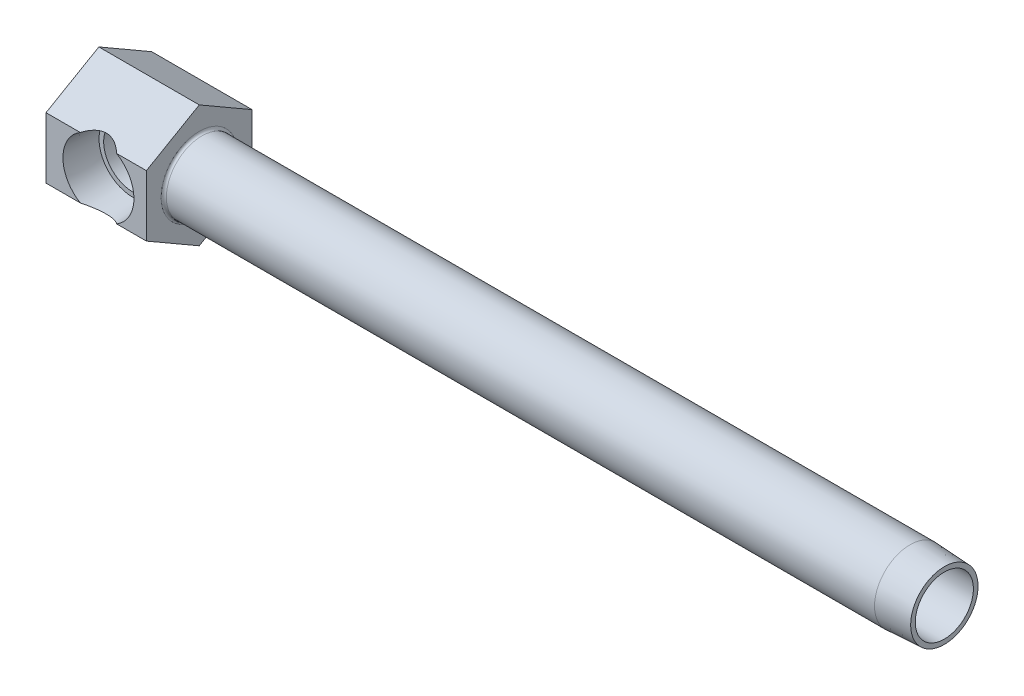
ISO-10303-21;
HEADER;
FILE_DESCRIPTION(('STEP AP214'),'2;1');
FILE_NAME('part.step','',(''),(''),'','','');
FILE_SCHEMA(('AUTOMOTIVE_DESIGN { 1 0 10303 214 1 1 1 1 }'));
ENDSEC;
DATA;
#1=APPLICATION_CONTEXT('core data for automotive mechanical design processes');
#2=APPLICATION_PROTOCOL_DEFINITION('international standard','automotive_design',2000,#1);
#3=PRODUCT_CONTEXT('',#1,'mechanical');
#4=PRODUCT('Part','Part','',(#3));
#5=PRODUCT_RELATED_PRODUCT_CATEGORY('part','',(#4));
#6=PRODUCT_DEFINITION_FORMATION('','',#4);
#7=PRODUCT_DEFINITION_CONTEXT('part definition',#1,'design');
#8=PRODUCT_DEFINITION('design','',#6,#7);
#9=PRODUCT_DEFINITION_SHAPE('','',#8);
#10=(LENGTH_UNIT() NAMED_UNIT(*) SI_UNIT(.MILLI.,.METRE.));
#11=(NAMED_UNIT(*) PLANE_ANGLE_UNIT() SI_UNIT($,.RADIAN.));
#12=(NAMED_UNIT(*) SI_UNIT($,.STERADIAN.) SOLID_ANGLE_UNIT());
#13=UNCERTAINTY_MEASURE_WITH_UNIT(LENGTH_MEASURE(1.E-05),#10,'distance_accuracy_value','');
#14=(GEOMETRIC_REPRESENTATION_CONTEXT(3) GLOBAL_UNCERTAINTY_ASSIGNED_CONTEXT((#13)) GLOBAL_UNIT_ASSIGNED_CONTEXT((#10,
#11,#12)) REPRESENTATION_CONTEXT('',''));
#15=CARTESIAN_POINT('',(0.,0.,0.));
#16=DIRECTION('',(0.,0.,1.));
#17=DIRECTION('',(1.,0.,0.));
#18=AXIS2_PLACEMENT_3D('',#15,#16,#17);
#19=CARTESIAN_POINT('',(30.1625,18.3308710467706,15.875));
#20=DIRECTION('',(0.,-0.866025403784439,-0.5));
#21=DIRECTION('',(0.,0.5,-0.866025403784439));
#22=AXIS2_PLACEMENT_3D('',#19,#20,#21);
#23=PLANE('',#22);
#24=CARTESIAN_POINT('',(15.748,-1.05255916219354,49.4480859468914));
#25=DIRECTION('',(0.,-0.866025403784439,-0.5));
#26=DIRECTION('',(0.,-0.5,0.866025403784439));
#27=AXIS2_PLACEMENT_3D('',#24,#25,#26);
#28=ELLIPSE('',#27,23.191034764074,11.5476466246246);
#29=CARTESIAN_POINT('',(21.2070306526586,9.16543552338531,31.75));
#30=VERTEX_POINT('',#29);
#31=CARTESIAN_POINT('',(10.2889693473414,9.16543552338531,31.75));
#32=VERTEX_POINT('',#31);
#33=EDGE_CURVE('E137',#30,#32,#28,.F.);
#34=ORIENTED_EDGE('',*,*,#33,.F.);
#35=DIRECTION('',(-1.,0.,0.));
#36=VECTOR('',#35,1.);
#37=CARTESIAN_POINT('',(30.1625,9.16543552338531,31.75));
#38=LINE('',#37,#36);
#39=CARTESIAN_POINT('',(30.1625,9.16543552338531,31.75));
#40=VERTEX_POINT('',#39);
#41=EDGE_CURVE('E181',#40,#30,#38,.T.);
#42=ORIENTED_EDGE('',*,*,#41,.F.);
#43=DIRECTION('',(0.,-0.5,0.866025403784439));
#44=VECTOR('',#43,1.);
#45=CARTESIAN_POINT('',(30.1625,18.3308710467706,15.875));
#46=LINE('',#45,#44);
#47=CARTESIAN_POINT('',(30.1625,18.3308710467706,15.875));
#48=VERTEX_POINT('',#47);
#49=EDGE_CURVE('E165',#48,#40,#46,.T.);
#50=ORIENTED_EDGE('',*,*,#49,.F.);
#51=DIRECTION('',(-1.,0.,0.));
#52=VECTOR('',#51,1.);
#53=CARTESIAN_POINT('',(30.1625,18.3308710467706,15.875));
#54=LINE('',#53,#52);
#55=CARTESIAN_POINT('',(0.,18.3308710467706,15.875));
#56=VERTEX_POINT('',#55);
#57=EDGE_CURVE('E184',#48,#56,#54,.T.);
#58=ORIENTED_EDGE('',*,*,#57,.T.);
#59=DIRECTION('',(0.,-0.5,0.866025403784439));
#60=VECTOR('',#59,1.);
#61=CARTESIAN_POINT('',(0.,18.3308710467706,15.875));
#62=LINE('',#61,#60);
#63=CARTESIAN_POINT('',(0.,9.16543552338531,31.75));
#64=VERTEX_POINT('',#63);
#65=EDGE_CURVE('E146',#56,#64,#62,.T.);
#66=ORIENTED_EDGE('',*,*,#65,.T.);
#67=EDGE_CURVE('E180',#32,#64,#38,.T.);
#68=ORIENTED_EDGE('',*,*,#67,.F.);
#69=EDGE_LOOP('',(#34,#42,#50,#58,#66,#68));
#70=FACE_BOUND('',#69,.T.);
#71=ADVANCED_FACE('F15',(#70),#23,.F.);
#72=CARTESIAN_POINT('',(30.1625,9.16543552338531,31.75));
#73=DIRECTION('',(0.,0.,-1.));
#74=DIRECTION('',(-1.,0.,0.));
#75=AXIS2_PLACEMENT_3D('',#72,#73,#74);
#76=PLANE('',#75);
#77=CARTESIAN_POINT('',(15.748,0.,31.75));
#78=DIRECTION('',(0.,0.,-1.));
#79=DIRECTION('',(-1.,0.,0.));
#80=AXIS2_PLACEMENT_3D('',#77,#78,#79);
#81=CIRCLE('',#80,10.668);
#82=CARTESIAN_POINT('',(21.2070306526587,-9.1654355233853,31.75));
#83=VERTEX_POINT('',#82);
#84=EDGE_CURVE('E135',#30,#83,#81,.T.);
#85=ORIENTED_EDGE('',*,*,#84,.T.);
#86=DIRECTION('',(-1.,0.,0.));
#87=VECTOR('',#86,1.);
#88=CARTESIAN_POINT('',(30.1625,-9.1654355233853,31.75));
#89=LINE('',#88,#87);
#90=CARTESIAN_POINT('',(30.1625,-9.1654355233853,31.75));
#91=VERTEX_POINT('',#90);
#92=EDGE_CURVE('E177',#91,#83,#89,.T.);
#93=ORIENTED_EDGE('',*,*,#92,.F.);
#94=DIRECTION('',(0.,-1.,0.));
#95=VECTOR('',#94,1.);
#96=CARTESIAN_POINT('',(30.1625,9.16543552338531,31.75));
#97=LINE('',#96,#95);
#98=EDGE_CURVE('E167',#40,#91,#97,.T.);
#99=ORIENTED_EDGE('',*,*,#98,.F.);
#100=ORIENTED_EDGE('',*,*,#41,.T.);
#101=EDGE_LOOP('',(#85,#93,#99,#100));
#102=FACE_BOUND('',#101,.T.);
#103=ADVANCED_FACE('F208',(#102),#76,.F.);
#104=CARTESIAN_POINT('',(10.2889693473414,-9.1654355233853,31.75));
#105=VERTEX_POINT('',#104);
#106=EDGE_CURVE('E42',#105,#32,#81,.T.);
#107=ORIENTED_EDGE('',*,*,#106,.T.);
#108=ORIENTED_EDGE('',*,*,#67,.T.);
#109=DIRECTION('',(0.,-1.,0.));
#110=VECTOR('',#109,1.);
#111=CARTESIAN_POINT('',(0.,9.16543552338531,31.75));
#112=LINE('',#111,#110);
#113=CARTESIAN_POINT('',(0.,-9.1654355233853,31.75));
#114=VERTEX_POINT('',#113);
#115=EDGE_CURVE('E150',#64,#114,#112,.T.);
#116=ORIENTED_EDGE('',*,*,#115,.T.);
#117=EDGE_CURVE('E176',#105,#114,#89,.T.);
#118=ORIENTED_EDGE('',*,*,#117,.F.);
#119=EDGE_LOOP('',(#107,#108,#116,#118));
#120=FACE_BOUND('',#119,.T.);
#121=ADVANCED_FACE('F214',(#120),#76,.F.);
#122=CARTESIAN_POINT('',(30.1625,-9.1654355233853,31.75));
#123=DIRECTION('',(0.,0.866025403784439,-0.5));
#124=DIRECTION('',(0.,0.5,0.866025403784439));
#125=AXIS2_PLACEMENT_3D('',#122,#123,#124);
#126=PLANE('',#125);
#127=CARTESIAN_POINT('',(15.748,1.05255916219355,49.4480859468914));
#128=DIRECTION('',(0.,0.866025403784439,-0.5));
#129=DIRECTION('',(0.,0.5,0.866025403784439));
#130=AXIS2_PLACEMENT_3D('',#127,#128,#129);
#131=ELLIPSE('',#130,23.191034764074,11.5476466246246);
#132=EDGE_CURVE('E28',#105,#83,#131,.F.);
#133=ORIENTED_EDGE('',*,*,#132,.F.);
#134=ORIENTED_EDGE('',*,*,#117,.T.);
#135=DIRECTION('',(0.,-0.5,-0.866025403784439));
#136=VECTOR('',#135,1.);
#137=CARTESIAN_POINT('',(0.,-9.1654355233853,31.75));
#138=LINE('',#137,#136);
#139=CARTESIAN_POINT('',(0.,-18.3308710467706,15.875));
#140=VERTEX_POINT('',#139);
#141=EDGE_CURVE('E154',#114,#140,#138,.T.);
#142=ORIENTED_EDGE('',*,*,#141,.T.);
#143=DIRECTION('',(-1.,0.,0.));
#144=VECTOR('',#143,1.);
#145=CARTESIAN_POINT('',(30.1625,-18.3308710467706,15.875));
#146=LINE('',#145,#144);
#147=CARTESIAN_POINT('',(30.1625,-18.3308710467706,15.875));
#148=VERTEX_POINT('',#147);
#149=EDGE_CURVE('E171',#148,#140,#146,.T.);
#150=ORIENTED_EDGE('',*,*,#149,.F.);
#151=DIRECTION('',(0.,-0.5,-0.866025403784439));
#152=VECTOR('',#151,1.);
#153=CARTESIAN_POINT('',(30.1625,-9.1654355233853,31.75));
#154=LINE('',#153,#152);
#155=EDGE_CURVE('E169',#91,#148,#154,.T.);
#156=ORIENTED_EDGE('',*,*,#155,.F.);
#157=ORIENTED_EDGE('',*,*,#92,.T.);
#158=EDGE_LOOP('',(#133,#134,#142,#150,#156,#157));
#159=FACE_BOUND('',#158,.T.);
#160=ADVANCED_FACE('F204',(#159),#126,.F.);
#161=CARTESIAN_POINT('',(30.1625,-18.3308710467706,15.875));
#162=DIRECTION('',(0.,0.866025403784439,0.5));
#163=DIRECTION('',(0.,-0.5,0.866025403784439));
#164=AXIS2_PLACEMENT_3D('',#161,#162,#163);
#165=PLANE('',#164);
#166=DIRECTION('',(0.,0.5,-0.866025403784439));
#167=VECTOR('',#166,1.);
#168=CARTESIAN_POINT('',(0.,-18.3308710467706,15.875));
#169=LINE('',#168,#167);
#170=CARTESIAN_POINT('',(0.,-9.16543552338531,0.));
#171=VERTEX_POINT('',#170);
#172=EDGE_CURVE('E139',#140,#171,#169,.T.);
#173=ORIENTED_EDGE('',*,*,#172,.T.);
#174=DIRECTION('',(-1.,0.,0.));
#175=VECTOR('',#174,1.);
#176=CARTESIAN_POINT('',(30.1625,-9.16543552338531,0.));
#177=LINE('',#176,#175);
#178=CARTESIAN_POINT('',(30.1625,-9.16543552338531,0.));
#179=VERTEX_POINT('',#178);
#180=EDGE_CURVE('E190',#179,#171,#177,.T.);
#181=ORIENTED_EDGE('',*,*,#180,.F.);
#182=DIRECTION('',(0.,0.5,-0.866025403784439));
#183=VECTOR('',#182,1.);
#184=CARTESIAN_POINT('',(30.1625,-18.3308710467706,15.875));
#185=LINE('',#184,#183);
#186=EDGE_CURVE('E157',#148,#179,#185,.T.);
#187=ORIENTED_EDGE('',*,*,#186,.F.);
#188=ORIENTED_EDGE('',*,*,#149,.T.);
#189=EDGE_LOOP('',(#173,#181,#187,#188));
#190=FACE_BOUND('',#189,.T.);
#191=ADVANCED_FACE('F17',(#190),#165,.F.);
#192=CARTESIAN_POINT('',(30.1625,-9.16543552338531,0.));
#193=DIRECTION('',(0.,0.,1.));
#194=DIRECTION('',(0.,-1.,0.));
#195=AXIS2_PLACEMENT_3D('',#192,#193,#194);
#196=PLANE('',#195);
#197=DIRECTION('',(0.,1.,0.));
#198=VECTOR('',#197,1.);
#199=CARTESIAN_POINT('',(0.,-9.16543552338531,0.));
#200=LINE('',#199,#198);
#201=CARTESIAN_POINT('',(0.,9.16543552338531,0.));
#202=VERTEX_POINT('',#201);
#203=EDGE_CURVE('E140',#171,#202,#200,.T.);
#204=ORIENTED_EDGE('',*,*,#203,.T.);
#205=DIRECTION('',(-1.,0.,0.));
#206=VECTOR('',#205,1.);
#207=CARTESIAN_POINT('',(30.1625,9.16543552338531,0.));
#208=LINE('',#207,#206);
#209=CARTESIAN_POINT('',(30.1625,9.16543552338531,0.));
#210=VERTEX_POINT('',#209);
#211=EDGE_CURVE('E187',#210,#202,#208,.T.);
#212=ORIENTED_EDGE('',*,*,#211,.F.);
#213=DIRECTION('',(0.,1.,0.));
#214=VECTOR('',#213,1.);
#215=CARTESIAN_POINT('',(30.1625,-9.16543552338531,0.));
#216=LINE('',#215,#214);
#217=EDGE_CURVE('E161',#179,#210,#216,.T.);
#218=ORIENTED_EDGE('',*,*,#217,.F.);
#219=ORIENTED_EDGE('',*,*,#180,.T.);
#220=EDGE_LOOP('',(#204,#212,#218,#219));
#221=FACE_BOUND('',#220,.T.);
#222=ADVANCED_FACE('F227',(#221),#196,.F.);
#223=CARTESIAN_POINT('',(30.1625,9.16543552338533,0.));
#224=DIRECTION('',(0.,-0.86602540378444,0.5));
#225=DIRECTION('',(0.,-0.5,-0.86602540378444));
#226=AXIS2_PLACEMENT_3D('',#223,#224,#225);
#227=PLANE('',#226);
#228=DIRECTION('',(0.,0.5,0.86602540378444));
#229=VECTOR('',#228,1.);
#230=CARTESIAN_POINT('',(0.,9.16543552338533,0.));
#231=LINE('',#230,#229);
#232=EDGE_CURVE('E143',#202,#56,#231,.T.);
#233=ORIENTED_EDGE('',*,*,#232,.T.);
#234=ORIENTED_EDGE('',*,*,#57,.F.);
#235=DIRECTION('',(0.,0.5,0.86602540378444));
#236=VECTOR('',#235,1.);
#237=CARTESIAN_POINT('',(30.1625,9.16543552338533,0.));
#238=LINE('',#237,#236);
#239=EDGE_CURVE('E163',#210,#48,#238,.T.);
#240=ORIENTED_EDGE('',*,*,#239,.F.);
#241=ORIENTED_EDGE('',*,*,#211,.T.);
#242=EDGE_LOOP('',(#233,#234,#240,#241));
#243=FACE_BOUND('',#242,.T.);
#244=ADVANCED_FACE('F233',(#243),#227,.F.);
#245=CARTESIAN_POINT('',(30.1625,-9.16543552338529,0.));
#246=DIRECTION('',(1.,0.,0.));
#247=DIRECTION('',(0.,1.,0.));
#248=AXIS2_PLACEMENT_3D('',#245,#246,#247);
#249=PLANE('',#248);
#250=CARTESIAN_POINT('',(30.1625,0.,15.875));
#251=DIRECTION('',(1.,0.,0.));
#252=DIRECTION('',(0.,1.,0.));
#253=AXIS2_PLACEMENT_3D('',#250,#251,#252);
#254=CIRCLE('',#253,11.4554);
#255=CARTESIAN_POINT('',(30.1625,11.4554,15.875));
#256=VERTEX_POINT('',#255);
#257=EDGE_CURVE('E196',#256,#256,#254,.F.);
#258=ORIENTED_EDGE('',*,*,#257,.T.);
#259=EDGE_LOOP('',(#258));
#260=FACE_BOUND('',#259,.T.);
#261=ORIENTED_EDGE('',*,*,#186,.T.);
#262=ORIENTED_EDGE('',*,*,#217,.T.);
#263=ORIENTED_EDGE('',*,*,#239,.T.);
#264=ORIENTED_EDGE('',*,*,#49,.T.);
#265=ORIENTED_EDGE('',*,*,#98,.T.);
#266=ORIENTED_EDGE('',*,*,#155,.T.);
#267=EDGE_LOOP('',(#261,#262,#263,#264,#265,#266));
#268=FACE_BOUND('',#267,.T.);
#269=ADVANCED_FACE('F230',(#260,#268),#249,.T.);
#270=CARTESIAN_POINT('',(0.,-9.16543552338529,0.));
#271=DIRECTION('',(1.,0.,0.));
#272=DIRECTION('',(0.,1.,0.));
#273=AXIS2_PLACEMENT_3D('',#270,#271,#272);
#274=PLANE('',#273);
#275=ORIENTED_EDGE('',*,*,#172,.F.);
#276=ORIENTED_EDGE('',*,*,#141,.F.);
#277=ORIENTED_EDGE('',*,*,#115,.F.);
#278=ORIENTED_EDGE('',*,*,#65,.F.);
#279=ORIENTED_EDGE('',*,*,#232,.F.);
#280=ORIENTED_EDGE('',*,*,#203,.F.);
#281=EDGE_LOOP('',(#275,#276,#277,#278,#279,#280));
#282=FACE_BOUND('',#281,.T.);
#283=ADVANCED_FACE('F222',(#282),#274,.F.);
#284=CARTESIAN_POINT('',(254.,0.,15.875));
#285=DIRECTION('',(-1.,0.,0.));
#286=DIRECTION('',(0.,0.,1.));
#287=AXIS2_PLACEMENT_3D('',#284,#285,#286);
#288=CYLINDRICAL_SURFACE('',#287,10.668);
#289=CARTESIAN_POINT('',(243.6876,0.,15.875));
#290=DIRECTION('',(-1.,0.,0.));
#291=DIRECTION('',(0.,0.,1.));
#292=AXIS2_PLACEMENT_3D('',#289,#290,#291);
#293=CIRCLE('',#292,10.6680000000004);
#294=CARTESIAN_POINT('',(243.6876,0.,26.5430000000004));
#295=VERTEX_POINT('',#294);
#296=EDGE_CURVE('E298',#295,#295,#293,.T.);
#297=ORIENTED_EDGE('',*,*,#296,.T.);
#298=EDGE_LOOP('',(#297));
#299=FACE_BOUND('',#298,.T.);
#300=CARTESIAN_POINT('',(30.9499,0.,15.875));
#301=DIRECTION('',(1.,0.,0.));
#302=DIRECTION('',(0.,1.,0.));
#303=AXIS2_PLACEMENT_3D('',#300,#301,#302);
#304=CIRCLE('',#303,10.668);
#305=CARTESIAN_POINT('',(30.9499,10.668,15.875));
#306=VERTEX_POINT('',#305);
#307=EDGE_CURVE('E193',#306,#306,#304,.T.);
#308=ORIENTED_EDGE('',*,*,#307,.T.);
#309=EDGE_LOOP('',(#308));
#310=FACE_BOUND('',#309,.T.);
#311=ADVANCED_FACE('F256',(#299,#310),#288,.T.);
#312=CARTESIAN_POINT('',(254.,0.,15.875));
#313=DIRECTION('',(-1.,0.,0.));
#314=DIRECTION('',(0.,0.,1.));
#315=AXIS2_PLACEMENT_3D('',#312,#313,#314);
#316=PLANE('',#315);
#317=CARTESIAN_POINT('',(254.,0.,15.875));
#318=DIRECTION('',(-1.,0.,0.));
#319=DIRECTION('',(0.,0.,1.));
#320=AXIS2_PLACEMENT_3D('',#317,#318,#319);
#321=CIRCLE('',#320,10.127550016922);
#322=CARTESIAN_POINT('',(254.,0.,26.002550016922));
#323=VERTEX_POINT('',#322);
#324=EDGE_CURVE('E301',#323,#323,#321,.T.);
#325=ORIENTED_EDGE('',*,*,#324,.F.);
#326=EDGE_LOOP('',(#325));
#327=FACE_BOUND('',#326,.T.);
#328=CARTESIAN_POINT('',(254.,0.,15.875));
#329=DIRECTION('',(1.,0.,0.));
#330=DIRECTION('',(0.,0.,-1.));
#331=AXIS2_PLACEMENT_3D('',#328,#329,#330);
#332=CIRCLE('',#331,8.73124999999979);
#333=CARTESIAN_POINT('',(254.,0.,7.14375000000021));
#334=VERTEX_POINT('',#333);
#335=EDGE_CURVE('E282',#334,#334,#332,.T.);
#336=ORIENTED_EDGE('',*,*,#335,.F.);
#337=EDGE_LOOP('',(#336));
#338=FACE_BOUND('',#337,.T.);
#339=ADVANCED_FACE('F259',(#327,#338),#316,.F.);
#340=CARTESIAN_POINT('',(30.9499,0.,15.875));
#341=DIRECTION('',(1.,0.,0.));
#342=DIRECTION('',(0.,1.,0.));
#343=AXIS2_PLACEMENT_3D('',#340,#341,#342);
#344=TOROIDAL_SURFACE('',#343,11.4554,0.7874);
#345=ORIENTED_EDGE('',*,*,#257,.F.);
#346=EDGE_LOOP('',(#345));
#347=FACE_BOUND('',#346,.T.);
#348=ORIENTED_EDGE('',*,*,#307,.F.);
#349=EDGE_LOOP('',(#348));
#350=FACE_BOUND('',#349,.T.);
#351=ADVANCED_FACE('F263',(#347,#350),#344,.F.);
#352=CARTESIAN_POINT('',(15.748,0.,31.75));
#353=DIRECTION('',(0.,0.,1.));
#354=DIRECTION('',(1.,0.,0.));
#355=AXIS2_PLACEMENT_3D('',#352,#353,#354);
#356=CONICAL_SURFACE('',#355,10.668,0.0523598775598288);
#357=CARTESIAN_POINT('',(23.3158678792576,-6.73011387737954,21.4374));
#358=CARTESIAN_POINT('',(23.4600282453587,-6.58213571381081,21.6163914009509));
#359=CARTESIAN_POINT('',(23.6023884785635,-6.42627781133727,21.7904706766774));
#360=CARTESIAN_POINT('',(23.8817354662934,-6.09837401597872,22.1280133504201));
#361=CARTESIAN_POINT('',(24.0187135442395,-5.92630339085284,22.2914598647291));
#362=CARTESIAN_POINT('',(24.2862441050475,-5.56440643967,22.6077795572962));
#363=CARTESIAN_POINT('',(24.4167288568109,-5.3744362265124,22.7605461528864));
#364=CARTESIAN_POINT('',(24.6677167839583,-4.97815123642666,23.0522714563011));
#365=CARTESIAN_POINT('',(24.7882261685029,-4.77184678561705,23.1912387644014));
#366=CARTESIAN_POINT('',(24.9921660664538,-4.38969848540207,23.4250980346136));
#367=CARTESIAN_POINT('',(25.0779672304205,-4.21696245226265,23.5230096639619));
#368=CARTESIAN_POINT('',(25.2408840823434,-3.86199712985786,23.7082473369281));
#369=CARTESIAN_POINT('',(25.3180018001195,-3.67977007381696,23.7955758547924));
#370=CARTESIAN_POINT('',(25.4621670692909,-3.30686520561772,23.9583559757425));
#371=CARTESIAN_POINT('',(25.529240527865,-3.11621083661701,24.0338381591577));
#372=CARTESIAN_POINT('',(25.6523303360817,-2.72696762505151,24.1720474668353));
#373=CARTESIAN_POINT('',(25.7083523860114,-2.52838293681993,24.2347811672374));
#374=CARTESIAN_POINT('',(25.808749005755,-2.12236093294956,24.3470188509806));
#375=CARTESIAN_POINT('',(25.8530023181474,-1.91485526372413,24.3963851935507));
#376=CARTESIAN_POINT('',(25.9281094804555,-1.49442789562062,24.4800766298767));
#377=CARTESIAN_POINT('',(25.9589631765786,-1.28150613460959,24.5144015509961));
#378=CARTESIAN_POINT('',(26.0065047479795,-0.852126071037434,24.5672608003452));
#379=CARTESIAN_POINT('',(26.023192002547,-0.635667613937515,24.5857944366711));
#380=CARTESIAN_POINT('',(26.0419565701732,-0.201352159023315,24.6066338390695));
#381=CARTESIAN_POINT('',(26.0440358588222,0.0165046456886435,24.6089417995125));
#382=CARTESIAN_POINT('',(26.0342583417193,0.421689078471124,24.5980844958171));
#383=CARTESIAN_POINT('',(26.0242658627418,0.609123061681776,24.5869892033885));
#384=CARTESIAN_POINT('',(25.9935596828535,0.982016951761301,24.552869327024));
#385=CARTESIAN_POINT('',(25.9728460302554,1.16747686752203,24.5298447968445));
#386=CARTESIAN_POINT('',(25.9211099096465,1.53498981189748,24.4722733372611));
#387=CARTESIAN_POINT('',(25.8900948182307,1.71704518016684,24.437734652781));
#388=CARTESIAN_POINT('',(25.8183100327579,2.07675633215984,24.3576745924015));
#389=CARTESIAN_POINT('',(25.7775399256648,2.25441192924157,24.3121527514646));
#390=CARTESIAN_POINT('',(25.6868155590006,2.60476748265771,24.2106610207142));
#391=CARTESIAN_POINT('',(25.6368406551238,2.77745527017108,24.1546676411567));
#392=CARTESIAN_POINT('',(25.5285266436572,3.1167166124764,24.0330221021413));
#393=CARTESIAN_POINT('',(25.4701845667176,3.28328797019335,23.9673665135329));
#394=CARTESIAN_POINT('',(25.2834921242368,3.77365322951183,23.7566792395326));
#395=CARTESIAN_POINT('',(25.1436492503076,4.08744436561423,23.5981203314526));
#396=CARTESIAN_POINT('',(24.8735653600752,4.61896069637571,23.289353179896));
#397=CARTESIAN_POINT('',(24.7480029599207,4.84261456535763,23.1450088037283));
#398=CARTESIAN_POINT('',(24.4850001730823,5.27158893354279,22.8402219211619));
#399=CARTESIAN_POINT('',(24.34754826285,5.47689124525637,22.6797637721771));
#400=CARTESIAN_POINT('',(24.0644488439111,5.86754844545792,22.3458754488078));
#401=CARTESIAN_POINT('',(23.918859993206,6.05302358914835,22.1725357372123));
#402=CARTESIAN_POINT('',(23.6957580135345,6.31733501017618,21.90341371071));
#403=CARTESIAN_POINT('',(23.6206767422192,6.40304815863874,21.8122772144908));
#404=CARTESIAN_POINT('',(23.4691939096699,6.56995442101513,21.6270388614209));
#405=CARTESIAN_POINT('',(23.3927925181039,6.65114811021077,21.5329373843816));
#406=CARTESIAN_POINT('',(23.3158678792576,6.73011387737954,21.4374));
#407=B_SPLINE_CURVE_WITH_KNOTS('',3,(#357,#358,#359,#360,#361,#362,#363,#364,#365,#366,#367,
#368,#369,#370,#371,#372,#373,#374,#375,#376,#377,#378,#379,#380,#381,#382,#383,#384,#385,#386,
#387,#388,#389,#390,#391,#392,#393,#394,#395,#396,#397,#398,#399,#400,#401,#402,#403,#404,#405,
#406),.UNSPECIFIED.,.F.,.F.,(4,2,2,2,2,2,2,2,2,2,2,2,2,2,2,2,2,2,2,2,2,2,2,2,4),(0.,
0.820023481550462,1.64131879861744,2.46989520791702,3.29795193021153,3.94627694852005,
4.59445010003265,5.24092150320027,5.8870585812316,6.53961554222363,7.19217999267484,
7.84477303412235,8.49727781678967,9.06067705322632,9.62407375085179,10.187067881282,
10.7500858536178,11.3143822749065,11.8788794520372,13.0099648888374,13.8917191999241,
14.7743379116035,15.65125682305,16.0888974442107,16.5264822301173),.UNSPECIFIED.);
#408=CARTESIAN_POINT('',(23.3160289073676,-6.72994857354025,21.4376));
#409=VERTEX_POINT('',#408);
#410=CARTESIAN_POINT('',(23.3160289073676,6.72994857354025,21.4376));
#411=VERTEX_POINT('',#410);
#412=EDGE_CURVE('E121',#409,#411,#407,.T.);
#413=ORIENTED_EDGE('',*,*,#412,.F.);
#414=CARTESIAN_POINT('',(15.748,0.,21.4376));
#415=DIRECTION('',(0.,0.,-1.));
#416=DIRECTION('',(-1.,0.,0.));
#417=AXIS2_PLACEMENT_3D('',#414,#415,#416);
#418=CIRCLE('',#417,10.1275500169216);
#419=EDGE_CURVE('E123',#409,#411,#418,.T.);
#420=ORIENTED_EDGE('',*,*,#419,.T.);
#421=EDGE_LOOP('',(#413,#420));
#422=FACE_BOUND('',#421,.T.);
#423=ORIENTED_EDGE('',*,*,#33,.T.);
#424=ORIENTED_EDGE('',*,*,#106,.F.);
#425=ORIENTED_EDGE('',*,*,#132,.T.);
#426=ORIENTED_EDGE('',*,*,#84,.F.);
#427=EDGE_LOOP('',(#423,#424,#425,#426));
#428=FACE_BOUND('',#427,.T.);
#429=ADVANCED_FACE('F198',(#422,#428),#356,.F.);
#430=CARTESIAN_POINT('',(25.8755500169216,0.,21.4376));
#431=DIRECTION('',(0.,0.,1.));
#432=DIRECTION('',(1.,0.,0.));
#433=AXIS2_PLACEMENT_3D('',#430,#431,#432);
#434=PLANE('',#433);
#435=DIRECTION('',(1.,0.,0.));
#436=VECTOR('',#435,1.);
#437=CARTESIAN_POINT('',(86.8155901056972,-6.72994857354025,21.4376));
#438=LINE('',#437,#436);
#439=CARTESIAN_POINT('',(21.3205618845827,-6.72994857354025,21.4376));
#440=VERTEX_POINT('',#439);
#441=EDGE_CURVE('E125',#440,#409,#438,.T.);
#442=ORIENTED_EDGE('',*,*,#441,.F.);
#443=CARTESIAN_POINT('',(15.748,0.,21.4376));
#444=DIRECTION('',(0.,0.,-1.));
#445=DIRECTION('',(-1.,0.,0.));
#446=AXIS2_PLACEMENT_3D('',#443,#444,#445);
#447=CIRCLE('',#446,8.7376);
#448=CARTESIAN_POINT('',(21.3205618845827,6.72994857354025,21.4376));
#449=VERTEX_POINT('',#448);
#450=EDGE_CURVE('E116',#440,#449,#447,.T.);
#451=ORIENTED_EDGE('',*,*,#450,.T.);
#452=DIRECTION('',(1.,0.,0.));
#453=VECTOR('',#452,1.);
#454=CARTESIAN_POINT('',(86.8155901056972,6.72994857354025,21.4376));
#455=LINE('',#454,#453);
#456=EDGE_CURVE('E117',#411,#449,#455,.F.);
#457=ORIENTED_EDGE('',*,*,#456,.F.);
#458=ORIENTED_EDGE('',*,*,#419,.F.);
#459=EDGE_LOOP('',(#442,#451,#457,#458));
#460=FACE_BOUND('',#459,.T.);
#461=ADVANCED_FACE('F270',(#460),#434,.T.);
#462=CARTESIAN_POINT('',(15.748,0.,43.0975954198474));
#463=DIRECTION('',(0.,0.,-1.));
#464=DIRECTION('',(-1.,0.,0.));
#465=AXIS2_PLACEMENT_3D('',#462,#463,#464);
#466=CYLINDRICAL_SURFACE('',#465,8.7376);
#467=CARTESIAN_POINT('',(24.4856,0.,7.14375000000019));
#468=CARTESIAN_POINT('',(24.4855979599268,-0.194584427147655,7.14375204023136));
#469=CARTESIAN_POINT('',(24.4790855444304,-0.389211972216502,7.15026918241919));
#470=CARTESIAN_POINT('',(24.4531687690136,-0.776828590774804,7.17620489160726));
#471=CARTESIAN_POINT('',(24.4337566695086,-0.969816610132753,7.19563120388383));
#472=CARTESIAN_POINT('',(24.3824080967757,-1.35279132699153,7.24701779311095));
#473=CARTESIAN_POINT('',(24.3504484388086,-1.54277178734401,7.27900127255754));
#474=CARTESIAN_POINT('',(24.2746397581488,-1.91800162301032,7.35486734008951));
#475=CARTESIAN_POINT('',(24.230784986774,-2.10324866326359,7.39875568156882));
#476=CARTESIAN_POINT('',(24.1323992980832,-2.46629304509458,7.49721818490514));
#477=CARTESIAN_POINT('',(24.0779544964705,-2.64413729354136,7.55170615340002));
#478=CARTESIAN_POINT('',(23.9590478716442,-2.99304779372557,7.67070931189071));
#479=CARTESIAN_POINT('',(23.8945822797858,-3.16411146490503,7.73522827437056));
#480=CARTESIAN_POINT('',(23.7566100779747,-3.49864884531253,7.8733179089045));
#481=CARTESIAN_POINT('',(23.6831076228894,-3.66212599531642,7.9468844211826));
#482=CARTESIAN_POINT('',(23.5279457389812,-3.98115293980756,8.10218588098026));
#483=CARTESIAN_POINT('',(23.4462844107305,-4.13670087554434,8.18392273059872));
#484=CARTESIAN_POINT('',(23.2407563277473,-4.50158308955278,8.38964777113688));
#485=CARTESIAN_POINT('',(23.1132942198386,-4.7068770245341,8.51723745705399));
#486=CARTESIAN_POINT('',(22.84617651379,-5.10080513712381,8.78463889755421));
#487=CARTESIAN_POINT('',(22.7065197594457,-5.28943773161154,8.92445181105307));
#488=CARTESIAN_POINT('',(22.4166157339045,-5.65057111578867,9.21470277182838));
#489=CARTESIAN_POINT('',(22.2663444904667,-5.82303320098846,9.36516487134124));
#490=CARTESIAN_POINT('',(21.9571971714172,-6.15161912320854,9.67473646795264));
#491=CARTESIAN_POINT('',(21.7983210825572,-6.30774293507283,9.833845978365));
#492=CARTESIAN_POINT('',(21.410466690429,-6.66146937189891,10.2223222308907));
#493=CARTESIAN_POINT('',(21.1781519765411,-6.85174414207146,10.4550504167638));
#494=CARTESIAN_POINT('',(20.7027527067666,-7.20301910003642,10.9314300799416));
#495=CARTESIAN_POINT('',(20.4596630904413,-7.364005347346,11.1750866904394));
#496=CARTESIAN_POINT('',(19.9655914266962,-7.65767994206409,11.6705392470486));
#497=CARTESIAN_POINT('',(19.7146188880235,-7.79040098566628,11.922325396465));
#498=CARTESIAN_POINT('',(19.2066974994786,-8.0288054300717,12.432296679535));
#499=CARTESIAN_POINT('',(18.9497514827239,-8.13450137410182,12.6904787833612));
#500=CARTESIAN_POINT('',(18.535849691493,-8.28254836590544,13.1070621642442));
#501=CARTESIAN_POINT('',(18.3802144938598,-8.3332845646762,13.2638590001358));
#502=CARTESIAN_POINT('',(18.0678223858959,-8.42559206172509,13.5791092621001));
#503=CARTESIAN_POINT('',(17.9110652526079,-8.46716148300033,13.7375630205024));
#504=CARTESIAN_POINT('',(17.6309955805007,-8.53322740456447,14.021580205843));
#505=CARTESIAN_POINT('',(17.5077848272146,-8.5594718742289,14.1468425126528));
#506=CARTESIAN_POINT('',(17.2618022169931,-8.60637337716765,14.3980579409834));
#507=CARTESIAN_POINT('',(17.1390302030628,-8.62704779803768,14.524007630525));
#508=CARTESIAN_POINT('',(16.9357825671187,-8.65687758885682,14.7346643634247));
#509=CARTESIAN_POINT('',(16.8550481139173,-8.66756378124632,14.8189101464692));
#510=CARTESIAN_POINT('',(16.6937016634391,-8.68665280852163,14.9894220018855));
#511=CARTESIAN_POINT('',(16.6130990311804,-8.69503164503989,15.0756998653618));
#512=CARTESIAN_POINT('',(16.4936864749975,-8.70581636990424,15.2075729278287));
#513=CARTESIAN_POINT('',(16.4538975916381,-8.7091283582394,15.2522143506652));
#514=CARTESIAN_POINT('',(16.3753514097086,-8.71513811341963,15.3428639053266));
#515=CARTESIAN_POINT('',(16.3366000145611,-8.71783283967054,15.3888775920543));
#516=CARTESIAN_POINT('',(16.262384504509,-8.72252382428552,15.4819945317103));
#517=CARTESIAN_POINT('',(16.2268715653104,-8.72453249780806,15.5290599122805));
#518=CARTESIAN_POINT('',(16.1615894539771,-8.72786360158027,15.6269900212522));
#519=CARTESIAN_POINT('',(16.1317624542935,-8.72919320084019,15.6778082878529));
#520=CARTESIAN_POINT('',(16.1060265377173,-8.73026315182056,15.7432733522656));
#521=CARTESIAN_POINT('',(16.1020065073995,-8.73042652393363,15.7545502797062));
#522=CARTESIAN_POINT('',(16.0948910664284,-8.73071197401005,15.7773932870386));
#523=CARTESIAN_POINT('',(16.0917959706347,-8.73083403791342,15.788959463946));
#524=CARTESIAN_POINT('',(16.0842173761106,-8.73113051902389,15.8238300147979));
#525=CARTESIAN_POINT('',(16.0813461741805,-8.73123899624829,15.847528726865));
#526=CARTESIAN_POINT('',(16.0808088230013,-8.73125946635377,15.8951415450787));
#527=CARTESIAN_POINT('',(16.0831777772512,-8.73117013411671,15.9190560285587));
#528=CARTESIAN_POINT('',(16.0925113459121,-8.73080677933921,15.9661053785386));
#529=CARTESIAN_POINT('',(16.0995149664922,-8.73053118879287,15.9892318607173));
#530=CARTESIAN_POINT('',(16.1262284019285,-8.72942751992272,16.0598051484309));
#531=CARTESIAN_POINT('',(16.1513370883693,-8.72832740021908,16.1050597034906));
#532=CARTESIAN_POINT('',(16.2067600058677,-8.72559491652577,16.1922079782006));
#533=CARTESIAN_POINT('',(16.2371111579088,-8.7239586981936,16.2340745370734));
#534=CARTESIAN_POINT('',(16.3394034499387,-8.71784635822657,16.3674166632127));
#535=CARTESIAN_POINT('',(16.4158450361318,-8.71237926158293,16.4553852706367));
#536=CARTESIAN_POINT('',(16.5713693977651,-8.69907947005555,16.6287851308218));
#537=CARTESIAN_POINT('',(16.6504566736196,-8.69124254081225,16.7142115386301));
#538=CARTESIAN_POINT('',(16.8096315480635,-8.67323190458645,16.8834717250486));
#539=CARTESIAN_POINT('',(16.8897156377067,-8.66306494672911,16.9673093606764));
#540=CARTESIAN_POINT('',(17.0502749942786,-8.64038918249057,17.1341543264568));
#541=CARTESIAN_POINT('',(17.130749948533,-8.62788201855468,17.2171621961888));
#542=CARTESIAN_POINT('',(17.3707828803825,-8.58710464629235,17.4636932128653));
#543=CARTESIAN_POINT('',(17.5305844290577,-8.55539515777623,17.6264322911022));
#544=CARTESIAN_POINT('',(17.849697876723,-8.48264950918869,17.9503078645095));
#545=CARTESIAN_POINT('',(18.0090097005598,-8.44161198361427,18.1114441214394));
#546=CARTESIAN_POINT('',(18.4856528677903,-8.30423407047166,18.5926956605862));
#547=CARTESIAN_POINT('',(18.8014587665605,-8.1936672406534,18.9104166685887));
#548=CARTESIAN_POINT('',(19.4255974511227,-7.93318916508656,19.5375986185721));
#549=CARTESIAN_POINT('',(19.7339228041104,-7.78324040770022,19.847051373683));
#550=CARTESIAN_POINT('',(20.339114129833,-7.44229907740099,20.4540803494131));
#551=CARTESIAN_POINT('',(20.6359893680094,-7.25134054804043,20.7516661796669));
#552=CARTESIAN_POINT('',(21.1000219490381,-6.91004415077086,21.2166598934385));
#553=CARTESIAN_POINT('',(21.2721889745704,-6.77335954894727,21.389148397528));
#554=CARTESIAN_POINT('',(21.6095045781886,-6.48366113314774,21.727043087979));
#555=CARTESIAN_POINT('',(21.7746536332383,-6.33064843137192,21.8924497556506));
#556=CARTESIAN_POINT('',(22.2570327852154,-5.84682072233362,22.3755293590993));
#557=CARTESIAN_POINT('',(22.5620480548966,-5.49060305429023,22.6809166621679));
#558=CARTESIAN_POINT('',(23.0699162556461,-4.78392446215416,23.1893448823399));
#559=CARTESIAN_POINT('',(23.2811256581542,-4.44561570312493,23.4007639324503));
#560=CARTESIAN_POINT('',(23.5668242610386,-3.90553017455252,23.6867285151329));
#561=CARTESIAN_POINT('',(23.6568667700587,-3.72007663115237,23.7768515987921));
#562=CARTESIAN_POINT('',(23.8252338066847,-3.3387620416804,23.9453649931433));
#563=CARTESIAN_POINT('',(23.9035605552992,-3.1429029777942,24.0237575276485));
#564=CARTESIAN_POINT('',(24.0342740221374,-2.77741093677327,24.1545782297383));
#565=CARTESIAN_POINT('',(24.0887969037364,-2.60930304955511,24.2091448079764));
#566=CARTESIAN_POINT('',(24.1881404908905,-2.2674535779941,24.3085667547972));
#567=CARTESIAN_POINT('',(24.2329631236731,-2.09371312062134,24.3534240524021));
#568=CARTESIAN_POINT('',(24.3121701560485,-1.74160557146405,24.4326916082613));
#569=CARTESIAN_POINT('',(24.3465592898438,-1.56324061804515,24.4671066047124));
#570=CARTESIAN_POINT('',(24.4043171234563,-1.20295803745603,24.5249075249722));
#571=CARTESIAN_POINT('',(24.427685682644,-1.02104036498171,24.548293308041));
#572=CARTESIAN_POINT('',(24.463023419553,-0.654283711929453,24.5836569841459));
#573=CARTESIAN_POINT('',(24.4749486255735,-0.469436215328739,24.5955908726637));
#574=CARTESIAN_POINT('',(24.4870048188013,-0.0989697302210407,24.6076558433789));
#575=CARTESIAN_POINT('',(24.4871357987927,0.0866492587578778,24.6077869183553));
#576=CARTESIAN_POINT('',(24.4756009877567,0.45715316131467,24.59624371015));
#577=CARTESIAN_POINT('',(24.4639348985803,0.642038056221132,24.5845691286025));
#578=CARTESIAN_POINT('',(24.4290390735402,1.00960102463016,24.5496476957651));
#579=CARTESIAN_POINT('',(24.4058095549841,1.19227913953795,24.5264010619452));
#580=CARTESIAN_POINT('',(24.3499037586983,1.54359781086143,24.4704535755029));
#581=CARTESIAN_POINT('',(24.3178522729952,1.7124387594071,24.4383780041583));
#582=CARTESIAN_POINT('',(24.2443827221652,2.04605005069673,24.3648524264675));
#583=CARTESIAN_POINT('',(24.2029611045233,2.21081882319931,24.3233988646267));
#584=CARTESIAN_POINT('',(24.1113637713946,2.53539687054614,24.231729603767));
#585=CARTESIAN_POINT('',(24.0611880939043,2.6952061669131,24.1815139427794));
#586=CARTESIAN_POINT('',(23.9527394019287,3.00923826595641,24.0729769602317));
#587=CARTESIAN_POINT('',(23.8944647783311,3.16345995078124,24.0146540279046));
#588=CARTESIAN_POINT('',(23.7478576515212,3.52103226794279,23.8679223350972));
#589=CARTESIAN_POINT('',(23.656318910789,3.72176242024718,23.7763035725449));
#590=CARTESIAN_POINT('',(23.4611265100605,4.11105686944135,23.5809334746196));
#591=CARTESIAN_POINT('',(23.3574693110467,4.29961758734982,23.4771785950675));
#592=CARTESIAN_POINT('',(23.1395028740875,4.6643909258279,23.2589969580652));
#593=CARTESIAN_POINT('',(23.0251788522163,4.84058579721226,23.1445553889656));
#594=CARTESIAN_POINT('',(22.7874660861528,5.18020722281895,22.9065848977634));
#595=CARTESIAN_POINT('',(22.6640769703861,5.34363325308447,22.7830556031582));
#596=CARTESIAN_POINT('',(22.3624933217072,5.71583582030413,22.4811084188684));
#597=CARTESIAN_POINT('',(22.1808835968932,5.91907945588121,22.2992637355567));
#598=CARTESIAN_POINT('',(21.8058537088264,6.30238103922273,21.9236994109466));
#599=CARTESIAN_POINT('',(21.6124292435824,6.48243046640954,21.7299754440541));
#600=CARTESIAN_POINT('',(21.2157200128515,6.82038910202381,21.3325794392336));
#601=CARTESIAN_POINT('',(21.0124171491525,6.97825543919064,21.1288891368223));
#602=CARTESIAN_POINT('',(20.5982380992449,7.27223101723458,20.7138083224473));
#603=CARTESIAN_POINT('',(20.3873623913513,7.40834162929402,20.5024182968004));
#604=CARTESIAN_POINT('',(19.8846490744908,7.7036329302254,19.9982794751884));
#605=CARTESIAN_POINT('',(19.5903051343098,7.85421669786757,19.7029484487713));
#606=CARTESIAN_POINT('',(19.1430322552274,8.05270383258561,19.2536843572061));
#607=CARTESIAN_POINT('',(18.9929116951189,8.11432340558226,19.1028145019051));
#608=CARTESIAN_POINT('',(18.6911065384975,8.22859693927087,18.7992470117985));
#609=CARTESIAN_POINT('',(18.5394220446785,8.28125148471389,18.6465494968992));
#610=CARTESIAN_POINT('',(18.2352261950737,8.37763466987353,18.3399014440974));
#611=CARTESIAN_POINT('',(18.0827174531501,8.42138304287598,18.1859544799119));
#612=CARTESIAN_POINT('',(17.7769311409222,8.50023585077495,17.8765529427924));
#613=CARTESIAN_POINT('',(17.6236534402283,8.53533876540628,17.7210981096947));
#614=CARTESIAN_POINT('',(17.3172180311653,8.59695458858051,17.4087584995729));
#615=CARTESIAN_POINT('',(17.1640603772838,8.62347694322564,17.2518754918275));
#616=CARTESIAN_POINT('',(16.8589569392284,8.66804695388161,16.9357683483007));
#617=CARTESIAN_POINT('',(16.7070105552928,8.68609909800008,16.7765454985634));
#618=CARTESIAN_POINT('',(16.4635040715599,8.70877341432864,16.5098735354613));
#619=CARTESIAN_POINT('',(16.3699008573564,8.71589085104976,16.4044258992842));
#620=CARTESIAN_POINT('',(16.2323264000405,8.72430499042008,16.2291085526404));
#621=CARTESIAN_POINT('',(16.1841543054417,8.72679002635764,16.1631387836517));
#622=CARTESIAN_POINT('',(16.1334968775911,8.729101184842,16.0698810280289));
#623=CARTESIAN_POINT('',(16.1225051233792,8.72957575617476,16.0475182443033));
#624=CARTESIAN_POINT('',(16.1036531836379,8.73036364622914,16.001517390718));
#625=CARTESIAN_POINT('',(16.0957832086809,8.73067746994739,15.977883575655));
#626=CARTESIAN_POINT('',(16.085825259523,8.73106804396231,15.9345234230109));
#627=CARTESIAN_POINT('',(16.0828762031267,8.73118048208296,15.9150042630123));
#628=CARTESIAN_POINT('',(16.080484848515,8.73127193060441,15.875763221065));
#629=CARTESIAN_POINT('',(16.0810378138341,8.73125112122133,15.856041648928));
#630=CARTESIAN_POINT('',(16.0854969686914,8.7310797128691,15.8170943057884));
#631=CARTESIAN_POINT('',(16.0893884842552,8.73092968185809,15.7978667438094));
#632=CARTESIAN_POINT('',(16.0998433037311,8.73051484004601,15.7601398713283));
#633=CARTESIAN_POINT('',(16.1064126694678,8.73024976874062,15.7416423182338));
#634=CARTESIAN_POINT('',(16.136469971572,8.72898749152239,15.6687660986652));
#635=CARTESIAN_POINT('',(16.1672759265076,8.72759479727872,15.617594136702));
#636=CARTESIAN_POINT('',(16.234348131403,8.72412321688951,15.518855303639));
#637=CARTESIAN_POINT('',(16.2706691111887,8.72203717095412,15.4713327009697));
#638=CARTESIAN_POINT('',(16.3943809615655,8.71408023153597,15.3171540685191));
#639=CARTESIAN_POINT('',(16.4865189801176,8.7068243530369,15.2143256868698));
#640=CARTESIAN_POINT('',(16.6731786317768,8.68900060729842,15.0111482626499));
#641=CARTESIAN_POINT('',(16.7677038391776,8.67842746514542,14.9108034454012));
#642=CARTESIAN_POINT('',(16.9573900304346,8.65402061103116,14.7119565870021));
#643=CARTESIAN_POINT('',(17.0525458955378,8.64020255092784,14.6134480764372));
#644=CARTESIAN_POINT('',(17.2430914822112,8.609279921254,14.4173129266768));
#645=CARTESIAN_POINT('',(17.338481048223,8.59217714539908,14.3196858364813));
#646=CARTESIAN_POINT('',(17.7459864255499,8.5120373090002,13.9038911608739));
#647=CARTESIAN_POINT('',(18.0580987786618,8.43292269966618,13.5886112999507));
#648=CARTESIAN_POINT('',(18.6776048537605,8.23825366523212,12.9641986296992));
#649=CARTESIAN_POINT('',(18.984994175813,8.12266719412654,12.6550714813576));
#650=CARTESIAN_POINT('',(19.5923220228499,7.85348929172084,12.0450114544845));
#651=CARTESIAN_POINT('',(19.8922482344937,7.69983911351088,11.7440920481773));
#652=CARTESIAN_POINT('',(20.4804833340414,7.3529430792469,11.1542044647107));
#653=CARTESIAN_POINT('',(20.7688011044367,7.15972821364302,10.865227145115));
#654=CARTESIAN_POINT('',(21.2206780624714,6.81483228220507,10.4124550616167));
#655=CARTESIAN_POINT('',(21.3891940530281,6.6761727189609,10.2436383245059));
#656=CARTESIAN_POINT('',(21.7190895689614,6.38282740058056,9.91319894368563));
#657=CARTESIAN_POINT('',(21.8804695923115,6.22814276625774,9.75157579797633));
#658=CARTESIAN_POINT('',(22.3513310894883,5.73984762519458,9.28005235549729));
#659=CARTESIAN_POINT('',(22.6484248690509,5.38133142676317,8.98260558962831));
#660=CARTESIAN_POINT('',(23.1414924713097,4.67228730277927,8.48900613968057));
#661=CARTESIAN_POINT('',(23.345909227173,4.33363653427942,8.284390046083));
#662=CARTESIAN_POINT('',(23.6214579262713,3.79409663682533,8.00858862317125));
#663=CARTESIAN_POINT('',(23.7081391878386,3.60895802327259,7.92183082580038));
#664=CARTESIAN_POINT('',(23.8698120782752,3.22869205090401,7.76001907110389));
#665=CARTESIAN_POINT('',(23.9448062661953,3.03356689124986,7.68496255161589));
#666=CARTESIAN_POINT('',(24.0697191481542,2.6692647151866,7.55994813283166));
#667=CARTESIAN_POINT('',(24.121729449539,2.50151910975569,7.50789648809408));
#668=CARTESIAN_POINT('',(24.2160793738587,2.16067893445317,7.41347268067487));
#669=CARTESIAN_POINT('',(24.2584209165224,1.98758543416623,7.37109859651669));
#670=CARTESIAN_POINT('',(24.332674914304,1.63737162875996,7.29678816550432));
#671=CARTESIAN_POINT('',(24.3646094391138,1.46026070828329,7.26482973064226));
#672=CARTESIAN_POINT('',(24.4175977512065,1.10287331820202,7.21180203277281));
#673=CARTESIAN_POINT('',(24.4386569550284,0.922598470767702,7.19072734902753));
#674=CARTESIAN_POINT('',(24.4645620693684,0.618421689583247,7.16480325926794));
#675=CARTESIAN_POINT('',(24.4724435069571,0.495022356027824,7.15691607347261));
#676=CARTESIAN_POINT('',(24.4829636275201,0.247754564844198,7.14638828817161));
#677=CARTESIAN_POINT('',(24.4856012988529,0.123886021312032,7.14374870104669));
#678=CARTESIAN_POINT('',(24.4856,0.,7.14375000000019));
#679=B_SPLINE_CURVE_WITH_KNOTS('',3,(#467,#468,#469,#470,#471,#472,#473,#474,#475,#476,#477,
#478,#479,#480,#481,#482,#483,#484,#485,#486,#487,#488,#489,#490,#491,#492,#493,#494,#495,#496,
#497,#498,#499,#500,#501,#502,#503,#504,#505,#506,#507,#508,#509,#510,#511,#512,#513,#514,#515,
#516,#517,#518,#519,#520,#521,#522,#523,#524,#525,#526,#527,#528,#529,#530,#531,#532,#533,#534,
#535,#536,#537,#538,#539,#540,#541,#542,#543,#544,#545,#546,#547,#548,#549,#550,#551,#552,#553,
#554,#555,#556,#557,#558,#559,#560,#561,#562,#563,#564,#565,#566,#567,#568,#569,#570,#571,#572,
#573,#574,#575,#576,#577,#578,#579,#580,#581,#582,#583,#584,#585,#586,#587,#588,#589,#590,#591,
#592,#593,#594,#595,#596,#597,#598,#599,#600,#601,#602,#603,#604,#605,#606,#607,#608,#609,#610,
#611,#612,#613,#614,#615,#616,#617,#618,#619,#620,#621,#622,#623,#624,#625,#626,#627,#628,#629,
#630,#631,#632,#633,#634,#635,#636,#637,#638,#639,#640,#641,#642,#643,#644,#645,#646,#647,#648,
#649,#650,#651,#652,#653,#654,#655,#656,#657,#658,#659,#660,#661,#662,#663,#664,#665,#666,#667,
#668,#669,#670,#671,#672,#673,#674,#675,#676,#677,#678),.UNSPECIFIED.,.T.,.F.,(4,2,2,2,2,2,2,2,
2,2,2,2,2,2,2,2,2,2,2,2,2,2,2,2,2,2,2,2,2,2,2,2,2,2,2,2,2,2,2,2,2,2,2,2,2,2,2,2,2,2,2,2,2,2,2,2,
2,2,2,2,2,2,2,2,2,2,2,2,2,2,2,2,2,2,2,2,2,2,2,2,2,2,2,2,2,2,2,2,2,2,2,2,2,2,2,2,2,2,2,2,2,2,2,2,
2,4),(0.,0.58361241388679,1.16757530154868,1.75262232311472,2.3379525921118,2.9187083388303,
3.49968302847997,4.08039159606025,4.66123567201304,5.47979311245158,6.29842824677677,
7.11897529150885,7.93952359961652,9.07759978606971,10.2162162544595,11.3535083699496,
12.4902716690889,13.1701291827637,13.85012577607,14.3830023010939,14.9141955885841,
15.2656970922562,15.6207271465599,15.8004033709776,15.9809464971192,16.158023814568,
16.3331909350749,16.3690696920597,16.4049606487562,16.4760278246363,16.5475725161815,
16.6197271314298,16.7737867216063,16.9289791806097,17.2784485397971,17.6285460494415,
17.9776420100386,18.3264938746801,19.0170858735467,19.7077790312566,21.0901665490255,
22.473875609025,23.8564404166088,24.6940964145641,25.5316953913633,27.2028655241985,
28.5515700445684,29.2258418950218,29.8999857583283,30.454322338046,31.008548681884,
31.5625231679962,32.1165047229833,32.6726065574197,33.2287087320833,33.7848249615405,
34.3409307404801,34.8648402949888,35.3889488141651,35.9130550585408,36.4372655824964,
37.152865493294,37.8686749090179,38.5854915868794,39.302337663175,40.2838426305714,
41.2657071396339,42.2494438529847,43.2331185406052,44.5610507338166,45.2256261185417,
45.8901581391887,46.5532013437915,47.2163610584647,47.8787882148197,48.5408639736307,
48.9645425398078,49.2083610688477,49.2829836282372,49.3573702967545,49.4163167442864,
49.4751834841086,49.5337928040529,49.5925355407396,49.7702540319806,49.9498678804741,
50.3640564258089,50.7789069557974,51.1917961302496,51.6044604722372,52.9547097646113,
54.3061487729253,55.6596867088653,57.0121684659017,57.8392729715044,58.6663196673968,
60.3161744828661,61.6467920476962,62.3123085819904,62.977679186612,63.5266629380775,
64.0755375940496,64.6232405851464,65.1706705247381,65.5421672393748,65.9137356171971),.UNSPECIFIED.);
#680=CARTESIAN_POINT('',(23.4105859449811,-4.19886060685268,8.21965571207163));
#681=VERTEX_POINT('',#680);
#682=EDGE_CURVE('E106',#681,#440,#679,.T.);
#683=ORIENTED_EDGE('',*,*,#682,.F.);
#684=CARTESIAN_POINT('',(15.748,0.,8.21965571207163));
#685=DIRECTION('',(0.,0.,-1.));
#686=DIRECTION('',(-1.,0.,0.));
#687=AXIS2_PLACEMENT_3D('',#684,#685,#686);
#688=CIRCLE('',#687,8.7376);
#689=CARTESIAN_POINT('',(23.410585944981,4.19886060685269,8.21965571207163));
#690=VERTEX_POINT('',#689);
#691=EDGE_CURVE('E114',#681,#690,#688,.T.);
#692=ORIENTED_EDGE('',*,*,#691,.T.);
#693=EDGE_CURVE('E34',#449,#690,#679,.T.);
#694=ORIENTED_EDGE('',*,*,#693,.F.);
#695=ORIENTED_EDGE('',*,*,#450,.F.);
#696=EDGE_LOOP('',(#683,#692,#694,#695));
#697=FACE_BOUND('',#696,.T.);
#698=ADVANCED_FACE('F113',(#697),#466,.F.);
#699=CARTESIAN_POINT('',(15.748,0.,8.21965571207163));
#700=DIRECTION('',(0.,0.,1.));
#701=DIRECTION('',(1.,0.,0.));
#702=AXIS2_PLACEMENT_3D('',#699,#700,#701);
#703=CONICAL_SURFACE('',#702,8.7376,1.0471975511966);
#704=CARTESIAN_POINT('',(23.4107811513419,4.19922522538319,8.21985571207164));
#705=CARTESIAN_POINT('',(23.367919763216,4.11919395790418,8.17595278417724));
#706=CARTESIAN_POINT('',(23.3270293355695,4.03767589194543,8.13287159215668));
#707=CARTESIAN_POINT('',(23.2492204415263,3.87181980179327,8.04860939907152));
#708=CARTESIAN_POINT('',(23.2123017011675,3.78748197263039,8.00742826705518));
#709=CARTESIAN_POINT('',(23.1076914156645,3.53082485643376,7.8872854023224));
#710=CARTESIAN_POINT('',(23.0459592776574,3.35451271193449,7.81153115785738));
#711=CARTESIAN_POINT('',(22.9381824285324,2.99497714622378,7.67123528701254));
#712=CARTESIAN_POINT('',(22.8919973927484,2.81183308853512,7.60659608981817));
#713=CARTESIAN_POINT('',(22.812716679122,2.43901153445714,7.48904901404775));
#714=CARTESIAN_POINT('',(22.7796265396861,2.24933131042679,7.43614610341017));
#715=CARTESIAN_POINT('',(22.7225896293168,1.85315874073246,7.34009061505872));
#716=CARTESIAN_POINT('',(22.6993570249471,1.64636373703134,7.29777066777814));
#717=CARTESIAN_POINT('',(22.6626845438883,1.2294252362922,7.22815478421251));
#718=CARTESIAN_POINT('',(22.6492454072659,1.01928148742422,7.20085998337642));
#719=CARTESIAN_POINT('',(22.6302721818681,0.596327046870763,7.16153764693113));
#720=CARTESIAN_POINT('',(22.6247719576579,0.383508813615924,7.1495755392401));
#721=CARTESIAN_POINT('',(22.6209210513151,-0.0424818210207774,7.14125475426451));
#722=CARTESIAN_POINT('',(22.6225699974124,-0.255654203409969,7.14489526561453));
#723=CARTESIAN_POINT('',(22.6333383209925,-0.683272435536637,7.16786503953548));
#724=CARTESIAN_POINT('',(22.6425377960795,-0.897707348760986,7.18736249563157));
#725=CARTESIAN_POINT('',(22.6699228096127,-1.32404956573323,7.24205141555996));
#726=CARTESIAN_POINT('',(22.6881097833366,-1.5359564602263,7.27724538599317));
#727=CARTESIAN_POINT('',(22.7356881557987,-1.95439228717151,7.36262974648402));
#728=CARTESIAN_POINT('',(22.765024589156,-2.16094237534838,7.41274631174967));
#729=CARTESIAN_POINT('',(22.8376796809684,-2.56751673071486,7.52712041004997));
#730=CARTESIAN_POINT('',(22.8809887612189,-2.76754536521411,7.59136824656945));
#731=CARTESIAN_POINT('',(22.9613447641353,-3.07251528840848,7.7013868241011));
#732=CARTESIAN_POINT('',(22.9927516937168,-3.18054225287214,7.74283631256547));
#733=CARTESIAN_POINT('',(23.0610067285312,-3.39337844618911,7.82932474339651));
#734=CARTESIAN_POINT('',(23.0978536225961,-3.49818838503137,7.87436288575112));
#735=CARTESIAN_POINT('',(23.1773744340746,-3.70471548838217,7.96786912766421));
#736=CARTESIAN_POINT('',(23.2200768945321,-3.80641431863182,8.01635343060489));
#737=CARTESIAN_POINT('',(23.3111685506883,-4.00587016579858,8.11612059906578));
#738=CARTESIAN_POINT('',(23.3595598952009,-4.10362567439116,8.16740451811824));
#739=CARTESIAN_POINT('',(23.4107811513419,-4.19922522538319,8.21985571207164));
#740=B_SPLINE_CURVE_WITH_KNOTS('',3,(#704,#705,#706,#707,#708,#709,#710,#711,#712,#713,#714,
#715,#716,#717,#718,#719,#720,#721,#722,#723,#724,#725,#726,#727,#728,#729,#730,#731,#732,#733,
#734,#735,#736,#737,#738,#739),.UNSPECIFIED.,.F.,.F.,(4,2,2,2,2,2,2,2,2,2,2,2,2,2,2,2,2,4),(0.,
0.302467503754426,0.604914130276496,1.20849247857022,1.80646706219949,2.40469428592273,
3.04091498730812,3.67718376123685,4.31615869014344,4.95510039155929,5.60090908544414,
6.24682094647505,6.88958900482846,7.53191738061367,7.89140548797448,8.25081367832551,
8.61204058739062,8.9734043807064),.UNSPECIFIED.);
#741=EDGE_CURVE('E10',#690,#681,#740,.T.);
#742=ORIENTED_EDGE('',*,*,#741,.F.);
#743=ORIENTED_EDGE('',*,*,#691,.F.);
#744=EDGE_LOOP('',(#742,#743));
#745=FACE_BOUND('',#744,.T.);
#746=CARTESIAN_POINT('',(15.748,0.,3.17500000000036));
#747=VERTEX_POINT('',#746);
#748=VERTEX_LOOP('',#747);
#749=FACE_BOUND('',#748,.T.);
#750=ADVANCED_FACE('F119',(#745,#749),#703,.F.);
#751=CARTESIAN_POINT('',(86.8155901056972,0.,15.875));
#752=DIRECTION('',(1.,0.,0.));
#753=DIRECTION('',(0.,0.,-1.));
#754=AXIS2_PLACEMENT_3D('',#751,#752,#753);
#755=CYLINDRICAL_SURFACE('',#754,8.73124999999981);
#756=ORIENTED_EDGE('',*,*,#412,.T.);
#757=ORIENTED_EDGE('',*,*,#456,.T.);
#758=ORIENTED_EDGE('',*,*,#693,.T.);
#759=ORIENTED_EDGE('',*,*,#741,.T.);
#760=ORIENTED_EDGE('',*,*,#682,.T.);
#761=ORIENTED_EDGE('',*,*,#441,.T.);
#762=EDGE_LOOP('',(#756,#757,#758,#759,#760,#761));
#763=FACE_BOUND('',#762,.T.);
#764=ORIENTED_EDGE('',*,*,#335,.T.);
#765=EDGE_LOOP('',(#764));
#766=FACE_BOUND('',#765,.T.);
#767=ADVANCED_FACE('F104',(#763,#766),#755,.F.);
#768=CARTESIAN_POINT('',(254.,0.,15.875));
#769=DIRECTION('',(-1.,0.,0.));
#770=DIRECTION('',(0.,0.,1.));
#771=AXIS2_PLACEMENT_3D('',#768,#769,#770);
#772=CONICAL_SURFACE('',#771,10.127550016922,0.0523598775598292);
#773=ORIENTED_EDGE('',*,*,#296,.F.);
#774=EDGE_LOOP('',(#773));
#775=FACE_BOUND('',#774,.T.);
#776=ORIENTED_EDGE('',*,*,#324,.T.);
#777=EDGE_LOOP('',(#776));
#778=FACE_BOUND('',#777,.T.);
#779=ADVANCED_FACE('F287',(#775,#778),#772,.T.);
#780=CLOSED_SHELL('',(#71,#103,#121,#160,#191,#222,#244,#269,#283,#311,#339,#351,#429,#461,#698,
#750,#767,#779));
#781=MANIFOLD_SOLID_BREP('B1',#780);
#782=ADVANCED_BREP_SHAPE_REPRESENTATION('',(#18,#781),#14);
#783=SHAPE_DEFINITION_REPRESENTATION(#9,#782);
ENDSEC;
END-ISO-10303-21;
